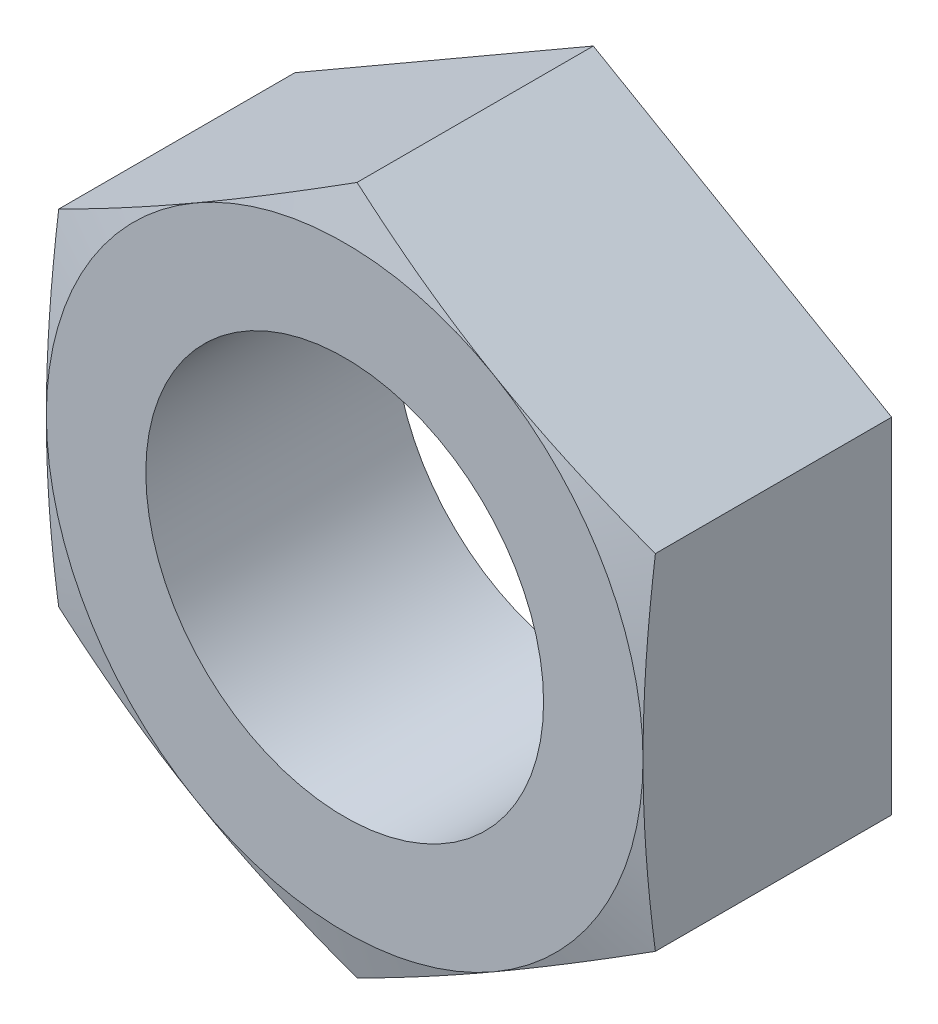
ISO-10303-21;
HEADER;
FILE_DESCRIPTION(('STEP AP214'),'2;1');
FILE_NAME('part.step','',(''),(''),'','','');
FILE_SCHEMA(('AUTOMOTIVE_DESIGN { 1 0 10303 214 1 1 1 1 }'));
ENDSEC;
DATA;
#1=APPLICATION_CONTEXT('core data for automotive mechanical design processes');
#2=APPLICATION_PROTOCOL_DEFINITION('international standard','automotive_design',2000,#1);
#3=PRODUCT_CONTEXT('',#1,'mechanical');
#4=PRODUCT('Part','Part','',(#3));
#5=PRODUCT_RELATED_PRODUCT_CATEGORY('part','',(#4));
#6=PRODUCT_DEFINITION_FORMATION('','',#4);
#7=PRODUCT_DEFINITION_CONTEXT('part definition',#1,'design');
#8=PRODUCT_DEFINITION('design','',#6,#7);
#9=PRODUCT_DEFINITION_SHAPE('','',#8);
#10=(LENGTH_UNIT() NAMED_UNIT(*) SI_UNIT(.MILLI.,.METRE.));
#11=(NAMED_UNIT(*) PLANE_ANGLE_UNIT() SI_UNIT($,.RADIAN.));
#12=(NAMED_UNIT(*) SI_UNIT($,.STERADIAN.) SOLID_ANGLE_UNIT());
#13=UNCERTAINTY_MEASURE_WITH_UNIT(LENGTH_MEASURE(1.E-05),#10,'distance_accuracy_value','');
#14=(GEOMETRIC_REPRESENTATION_CONTEXT(3) GLOBAL_UNCERTAINTY_ASSIGNED_CONTEXT((#13)) GLOBAL_UNIT_ASSIGNED_CONTEXT((#10,
#11,#12)) REPRESENTATION_CONTEXT('',''));
#15=CARTESIAN_POINT('',(0.,0.,0.));
#16=DIRECTION('',(0.,0.,1.));
#17=DIRECTION('',(1.,0.,0.));
#18=AXIS2_PLACEMENT_3D('',#15,#16,#17);
#19=CARTESIAN_POINT('',(0.,0.,10.));
#20=DIRECTION('',(0.,0.,1.));
#21=DIRECTION('',(1.,0.,0.));
#22=AXIS2_PLACEMENT_3D('',#19,#20,#21);
#23=PLANE('',#22);
#24=CARTESIAN_POINT('',(0.,0.,10.));
#25=DIRECTION('',(0.,0.,1.));
#26=DIRECTION('',(1.,0.,0.));
#27=AXIS2_PLACEMENT_3D('',#24,#25,#26);
#28=CIRCLE('',#27,8.);
#29=CARTESIAN_POINT('',(8.,0.,10.));
#30=VERTEX_POINT('',#29);
#31=EDGE_CURVE('E248',#30,#30,#28,.T.);
#32=ORIENTED_EDGE('',*,*,#31,.F.);
#33=EDGE_LOOP('',(#32));
#34=FACE_BOUND('',#33,.T.);
#35=CARTESIAN_POINT('',(0.,0.,10.));
#36=DIRECTION('',(0.,0.,1.));
#37=DIRECTION('',(1.,0.,0.));
#38=AXIS2_PLACEMENT_3D('',#35,#36,#37);
#39=CIRCLE('',#38,12.);
#40=CARTESIAN_POINT('',(6.,-10.3923048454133,10.));
#41=VERTEX_POINT('',#40);
#42=CARTESIAN_POINT('',(12.,0.,10.));
#43=VERTEX_POINT('',#42);
#44=EDGE_CURVE('E118',#41,#43,#39,.T.);
#45=ORIENTED_EDGE('',*,*,#44,.T.);
#46=CARTESIAN_POINT('',(6.,10.3923048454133,10.));
#47=VERTEX_POINT('',#46);
#48=EDGE_CURVE('E102',#43,#47,#39,.T.);
#49=ORIENTED_EDGE('',*,*,#48,.T.);
#50=CARTESIAN_POINT('',(-6.,10.3923048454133,10.));
#51=VERTEX_POINT('',#50);
#52=EDGE_CURVE('E92',#47,#51,#39,.T.);
#53=ORIENTED_EDGE('',*,*,#52,.T.);
#54=CARTESIAN_POINT('',(-12.,0.,10.));
#55=VERTEX_POINT('',#54);
#56=EDGE_CURVE('E36',#51,#55,#39,.T.);
#57=ORIENTED_EDGE('',*,*,#56,.T.);
#58=CARTESIAN_POINT('',(-6.,-10.3923048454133,10.));
#59=VERTEX_POINT('',#58);
#60=EDGE_CURVE('E44',#55,#59,#39,.T.);
#61=ORIENTED_EDGE('',*,*,#60,.T.);
#62=EDGE_CURVE('E122',#59,#41,#39,.T.);
#63=ORIENTED_EDGE('',*,*,#62,.T.);
#64=EDGE_LOOP('',(#45,#49,#53,#57,#61,#63));
#65=FACE_BOUND('',#64,.T.);
#66=ADVANCED_FACE('F14',(#34,#65),#23,.T.);
#67=CARTESIAN_POINT('',(12.,6.92820323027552,10.));
#68=DIRECTION('',(-0.5,-0.866025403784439,0.));
#69=DIRECTION('',(0.866025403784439,-0.5,0.));
#70=AXIS2_PLACEMENT_3D('',#67,#68,#69);
#71=PLANE('',#70);
#72=CARTESIAN_POINT('',(12.0002,6.92808776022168,9.50254644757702));
#73=CARTESIAN_POINT('',(11.5018535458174,7.2158082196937,9.57967201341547));
#74=CARTESIAN_POINT('',(11.0026035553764,7.50405033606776,9.6496892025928));
#75=CARTESIAN_POINT('',(10.0023405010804,8.08155247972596,9.7727027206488));
#76=CARTESIAN_POINT('',(9.50132680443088,8.37081287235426,9.82569213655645));
#77=CARTESIAN_POINT('',(8.50057386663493,8.94859785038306,9.91155672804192));
#78=CARTESIAN_POINT('',(8.00084139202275,9.2371185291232,9.94453429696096));
#79=CARTESIAN_POINT('',(7.00073918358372,9.81452780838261,9.98875383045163));
#80=CARTESIAN_POINT('',(6.50036959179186,10.1034163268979,10.));
#81=CARTESIAN_POINT('',(5.49963040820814,10.6811933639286,10.));
#82=CARTESIAN_POINT('',(4.99926081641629,10.9700818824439,9.98875383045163));
#83=CARTESIAN_POINT('',(3.99915860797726,11.5474911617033,9.94453429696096));
#84=CARTESIAN_POINT('',(3.49942613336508,11.8360118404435,9.91155672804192));
#85=CARTESIAN_POINT('',(2.49867319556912,12.4137968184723,9.82569213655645));
#86=CARTESIAN_POINT('',(1.99765949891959,12.7030572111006,9.7727027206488));
#87=CARTESIAN_POINT('',(0.997396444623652,13.2805593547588,9.6496892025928));
#88=CARTESIAN_POINT('',(0.498146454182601,13.5688014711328,9.57967201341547));
#89=CARTESIAN_POINT('',(-0.000199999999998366,13.8565219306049,9.50254644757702));
#90=B_SPLINE_CURVE_WITH_KNOTS('',3,(#72,#73,#74,#75,#76,#77,#78,#79,#80,#81,#82,#83,#84,#85,#86,
#87,#88,#89),.UNSPECIFIED.,.F.,.F.,(4,2,2,2,2,2,2,2,4),(0.,1.74185054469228,3.48440735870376,
5.21797126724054,6.95119970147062,8.68442813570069,10.4179920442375,12.160548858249,
13.9023994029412),.UNSPECIFIED.);
#91=CARTESIAN_POINT('',(12.,6.92820323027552,9.50257738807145));
#92=VERTEX_POINT('',#91);
#93=EDGE_CURVE('E107',#92,#47,#90,.T.);
#94=ORIENTED_EDGE('',*,*,#93,.F.);
#95=DIRECTION('',(0.,0.,-1.));
#96=VECTOR('',#95,1.);
#97=CARTESIAN_POINT('',(12.,6.92820323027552,10.));
#98=LINE('',#97,#96);
#99=CARTESIAN_POINT('',(12.,6.92820323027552,0.));
#100=VERTEX_POINT('',#99);
#101=EDGE_CURVE('E224',#92,#100,#98,.T.);
#102=ORIENTED_EDGE('',*,*,#101,.T.);
#103=DIRECTION('',(-0.866025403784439,0.5,0.));
#104=VECTOR('',#103,1.);
#105=CARTESIAN_POINT('',(12.,6.92820323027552,0.));
#106=LINE('',#105,#104);
#107=CARTESIAN_POINT('',(0.,13.856406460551,0.));
#108=VERTEX_POINT('',#107);
#109=EDGE_CURVE('E246',#100,#108,#106,.T.);
#110=ORIENTED_EDGE('',*,*,#109,.T.);
#111=DIRECTION('',(0.,0.,-1.));
#112=VECTOR('',#111,1.);
#113=CARTESIAN_POINT('',(0.,13.856406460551,10.));
#114=LINE('',#113,#112);
#115=CARTESIAN_POINT('',(0.,13.856406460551,9.50257738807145));
#116=VERTEX_POINT('',#115);
#117=EDGE_CURVE('E115',#116,#108,#114,.T.);
#118=ORIENTED_EDGE('',*,*,#117,.F.);
#119=EDGE_CURVE('E96',#47,#116,#90,.T.);
#120=ORIENTED_EDGE('',*,*,#119,.F.);
#121=EDGE_LOOP('',(#94,#102,#110,#118,#120));
#122=FACE_BOUND('',#121,.T.);
#123=ADVANCED_FACE('F16',(#122),#71,.F.);
#124=CARTESIAN_POINT('',(0.,13.856406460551,10.));
#125=DIRECTION('',(0.5,-0.866025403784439,0.));
#126=DIRECTION('',(0.866025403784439,0.5,0.));
#127=AXIS2_PLACEMENT_3D('',#124,#125,#126);
#128=PLANE('',#127);
#129=CARTESIAN_POINT('',(0.00020000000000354,13.8565219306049,9.50254644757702));
#130=CARTESIAN_POINT('',(-0.498146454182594,13.5688014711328,9.57967201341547));
#131=CARTESIAN_POINT('',(-0.997396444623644,13.2805593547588,9.6496892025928));
#132=CARTESIAN_POINT('',(-1.99765949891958,12.7030572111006,9.7727027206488));
#133=CARTESIAN_POINT('',(-2.49867319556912,12.4137968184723,9.82569213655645));
#134=CARTESIAN_POINT('',(-3.49942613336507,11.8360118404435,9.91155672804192));
#135=CARTESIAN_POINT('',(-3.99915860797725,11.5474911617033,9.94453429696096));
#136=CARTESIAN_POINT('',(-4.99926081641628,10.9700818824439,9.98875383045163));
#137=CARTESIAN_POINT('',(-5.49963040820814,10.6811933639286,10.));
#138=CARTESIAN_POINT('',(-6.50036959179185,10.1034163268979,10.));
#139=CARTESIAN_POINT('',(-7.00073918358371,9.8145278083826,9.98875383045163));
#140=CARTESIAN_POINT('',(-8.00084139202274,9.23711852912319,9.94453429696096));
#141=CARTESIAN_POINT('',(-8.50057386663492,8.94859785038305,9.91155672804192));
#142=CARTESIAN_POINT('',(-9.50132680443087,8.37081287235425,9.82569213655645));
#143=CARTESIAN_POINT('',(-10.0023405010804,8.08155247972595,9.7727027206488));
#144=CARTESIAN_POINT('',(-11.0026035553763,7.50405033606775,9.6496892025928));
#145=CARTESIAN_POINT('',(-11.5018535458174,7.2158082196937,9.57967201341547));
#146=CARTESIAN_POINT('',(-12.0002,6.92808776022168,9.50254644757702));
#147=B_SPLINE_CURVE_WITH_KNOTS('',3,(#129,#130,#131,#132,#133,#134,#135,#136,#137,#138,#139,
#140,#141,#142,#143,#144,#145,#146),.UNSPECIFIED.,.F.,.F.,(4,2,2,2,2,2,2,2,4),(0.,
1.74185054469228,3.48440735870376,5.21797126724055,6.95119970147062,8.68442813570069,
10.4179920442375,12.160548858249,13.9023994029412),.UNSPECIFIED.);
#148=EDGE_CURVE('E98',#116,#51,#147,.T.);
#149=ORIENTED_EDGE('',*,*,#148,.F.);
#150=ORIENTED_EDGE('',*,*,#117,.T.);
#151=DIRECTION('',(-0.866025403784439,-0.5,0.));
#152=VECTOR('',#151,1.);
#153=CARTESIAN_POINT('',(0.,13.856406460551,0.));
#154=LINE('',#153,#152);
#155=CARTESIAN_POINT('',(-12.,6.92820323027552,0.));
#156=VERTEX_POINT('',#155);
#157=EDGE_CURVE('E244',#108,#156,#154,.T.);
#158=ORIENTED_EDGE('',*,*,#157,.T.);
#159=DIRECTION('',(0.,0.,-1.));
#160=VECTOR('',#159,1.);
#161=CARTESIAN_POINT('',(-12.,6.92820323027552,10.));
#162=LINE('',#161,#160);
#163=CARTESIAN_POINT('',(-12.,6.92820323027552,9.50257738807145));
#164=VERTEX_POINT('',#163);
#165=EDGE_CURVE('E225',#164,#156,#162,.T.);
#166=ORIENTED_EDGE('',*,*,#165,.F.);
#167=EDGE_CURVE('E171',#51,#164,#147,.T.);
#168=ORIENTED_EDGE('',*,*,#167,.F.);
#169=EDGE_LOOP('',(#149,#150,#158,#166,#168));
#170=FACE_BOUND('',#169,.T.);
#171=ADVANCED_FACE('F182',(#170),#128,.F.);
#172=CARTESIAN_POINT('',(-12.,6.92820323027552,10.));
#173=DIRECTION('',(1.,0.,0.));
#174=DIRECTION('',(0.,1.,0.));
#175=AXIS2_PLACEMENT_3D('',#172,#173,#174);
#176=PLANE('',#175);
#177=CARTESIAN_POINT('',(-12.,-18.3760772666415,7.33465196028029));
#178=CARTESIAN_POINT('',(-12.,-17.8311157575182,7.45688131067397));
#179=CARTESIAN_POINT('',(-12.,-17.2858147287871,7.57762386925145));
#180=CARTESIAN_POINT('',(-12.,-16.1943667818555,7.81533278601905));
#181=CARTESIAN_POINT('',(-12.,-15.6482198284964,7.932298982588));
#182=CARTESIAN_POINT('',(-12.,-14.5544308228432,8.16175292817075));
#183=CARTESIAN_POINT('',(-12.,-14.006787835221,8.2742362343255));
#184=CARTESIAN_POINT('',(-12.,-12.9103655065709,8.49351801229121));
#185=CARTESIAN_POINT('',(-12.,-12.361586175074,8.60031653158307));
#186=CARTESIAN_POINT('',(-12.,-11.2670719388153,8.80605034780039));
#187=CARTESIAN_POINT('',(-12.,-10.721347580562,8.90504147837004));
#188=CARTESIAN_POINT('',(-12.,-9.62839905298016,9.09443694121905));
#189=CARTESIAN_POINT('',(-12.,-9.08117487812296,9.18484124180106));
#190=CARTESIAN_POINT('',(-12.,-7.98513551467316,9.3550337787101));
#191=CARTESIAN_POINT('',(-12.,-7.43632053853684,9.43482337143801));
#192=CARTESIAN_POINT('',(-12.,-6.33694259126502,9.58144539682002));
#193=CARTESIAN_POINT('',(-12.,-5.78637961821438,9.6482778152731));
#194=CARTESIAN_POINT('',(-12.,-4.67727363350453,9.76710367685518));
#195=CARTESIAN_POINT('',(-12.,-4.11871125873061,9.81891906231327));
#196=CARTESIAN_POINT('',(-12.,-3.0001718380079,9.90414274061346));
#197=CARTESIAN_POINT('',(-12.,-2.44019482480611,9.93755145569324));
#198=CARTESIAN_POINT('',(-12.,-1.31963996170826,9.98401383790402));
#199=CARTESIAN_POINT('',(-12.,-0.759062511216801,9.99707694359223));
#200=CARTESIAN_POINT('',(-12.,0.362187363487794,10.002043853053));
#201=CARTESIAN_POINT('',(-12.,0.922859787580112,9.99394768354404));
#202=CARTESIAN_POINT('',(-12.,2.04555807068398,9.9570507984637));
#203=CARTESIAN_POINT('',(-12.,2.60758139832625,9.9281746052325));
#204=CARTESIAN_POINT('',(-12.,3.73031273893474,9.85137028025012));
#205=CARTESIAN_POINT('',(-12.,4.29102072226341,9.80344172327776));
#206=CARTESIAN_POINT('',(-12.,5.41111567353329,9.69096567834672));
#207=CARTESIAN_POINT('',(-12.,5.97050152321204,9.62640722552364));
#208=CARTESIAN_POINT('',(-12.,7.08747104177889,9.48337256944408));
#209=CARTESIAN_POINT('',(-12.,7.64505470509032,9.40489632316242));
#210=CARTESIAN_POINT('',(-12.,8.72595613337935,9.24146783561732));
#211=CARTESIAN_POINT('',(-12.,9.24937259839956,9.15716182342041));
#212=CARTESIAN_POINT('',(-12.,10.2948126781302,8.98027669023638));
#213=CARTESIAN_POINT('',(-12.,10.8168362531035,8.88769733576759));
#214=CARTESIAN_POINT('',(-12.,11.8596911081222,8.69578846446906));
#215=CARTESIAN_POINT('',(-12.,12.3805222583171,8.59645824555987));
#216=CARTESIAN_POINT('',(-12.,13.4210973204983,8.39230238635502));
#217=CARTESIAN_POINT('',(-12.,13.9408412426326,8.28747679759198));
#218=CARTESIAN_POINT('',(-12.,14.9795291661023,8.07330464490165));
#219=CARTESIAN_POINT('',(-12.,15.4984729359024,7.96395696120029));
#220=CARTESIAN_POINT('',(-12.,16.5355673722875,7.74155770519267));
#221=CARTESIAN_POINT('',(-12.,17.0537180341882,7.62850611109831));
#222=CARTESIAN_POINT('',(-12.,18.6070874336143,7.28480299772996));
#223=CARTESIAN_POINT('',(-12.,19.6412960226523,7.04958801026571));
#224=CARTESIAN_POINT('',(-12.,21.6975152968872,6.57306070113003));
#225=CARTESIAN_POINT('',(-12.,22.7195454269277,6.33183173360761));
#226=CARTESIAN_POINT('',(-12.,24.7621852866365,5.84335995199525));
#227=CARTESIAN_POINT('',(-12.,25.7827949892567,5.59611702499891));
#228=CARTESIAN_POINT('',(-12.,27.8216374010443,5.09750048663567));
#229=CARTESIAN_POINT('',(-12.,28.8398714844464,4.84613248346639));
#230=CARTESIAN_POINT('',(-12.,30.366576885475,4.46655908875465));
#231=CARTESIAN_POINT('',(-12.,30.875362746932,4.33961648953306));
#232=CARTESIAN_POINT('',(-12.,31.892747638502,4.08498700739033));
#233=CARTESIAN_POINT('',(-12.,32.4013466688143,3.95730012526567));
#234=CARTESIAN_POINT('',(-12.,32.9098642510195,3.82928971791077));
#235=B_SPLINE_CURVE_WITH_KNOTS('',3,(#177,#178,#179,#180,#181,#182,#183,#184,#185,#186,#187,
#188,#189,#190,#191,#192,#193,#194,#195,#196,#197,#198,#199,#200,#201,#202,#203,#204,#205,#206,
#207,#208,#209,#210,#211,#212,#213,#214,#215,#216,#217,#218,#219,#220,#221,#222,#223,#224,#225,
#226,#227,#228,#229,#230,#231,#232,#233,#234),.UNSPECIFIED.,.F.,.F.,(4,2,2,2,2,2,2,2,2,2,2,2,2,
2,2,2,2,2,2,2,2,2,2,2,2,2,2,2,4),(0.,1.675508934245,3.35108948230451,5.02829132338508,
6.70547915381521,8.36931403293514,10.0331550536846,11.6967832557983,13.3604132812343,
15.043029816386,16.7256077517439,18.4074048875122,20.0891998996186,21.7771345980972,
23.4651069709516,25.1541951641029,26.843288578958,28.433697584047,30.0241514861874,
31.6147710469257,33.2053756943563,34.7963765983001,36.3873868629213,39.5691854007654,
42.7195027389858,45.8698792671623,49.0162790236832,50.5894274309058,52.1625741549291),.UNSPECIFIED.);
#236=EDGE_CURVE('E176',#164,#55,#235,.F.);
#237=ORIENTED_EDGE('',*,*,#236,.F.);
#238=ORIENTED_EDGE('',*,*,#165,.T.);
#239=DIRECTION('',(0.,-1.,0.));
#240=VECTOR('',#239,1.);
#241=CARTESIAN_POINT('',(-12.,6.92820323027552,0.));
#242=LINE('',#241,#240);
#243=CARTESIAN_POINT('',(-12.,-6.92820323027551,0.));
#244=VERTEX_POINT('',#243);
#245=EDGE_CURVE('E241',#156,#244,#242,.T.);
#246=ORIENTED_EDGE('',*,*,#245,.T.);
#247=DIRECTION('',(0.,0.,-1.));
#248=VECTOR('',#247,1.);
#249=CARTESIAN_POINT('',(-12.,-6.92820323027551,10.));
#250=LINE('',#249,#248);
#251=CARTESIAN_POINT('',(-12.,-6.92820323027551,9.50257738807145));
#252=VERTEX_POINT('',#251);
#253=EDGE_CURVE('E228',#252,#244,#250,.T.);
#254=ORIENTED_EDGE('',*,*,#253,.F.);
#255=EDGE_CURVE('E134',#55,#252,#235,.F.);
#256=ORIENTED_EDGE('',*,*,#255,.F.);
#257=EDGE_LOOP('',(#237,#238,#246,#254,#256));
#258=FACE_BOUND('',#257,.T.);
#259=ADVANCED_FACE('F185',(#258),#176,.F.);
#260=CARTESIAN_POINT('',(-12.,-6.92820323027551,10.));
#261=DIRECTION('',(0.5,0.866025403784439,0.));
#262=DIRECTION('',(-0.866025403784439,0.5,0.));
#263=AXIS2_PLACEMENT_3D('',#260,#261,#262);
#264=PLANE('',#263);
#265=CARTESIAN_POINT('',(-12.0002,-6.92808776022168,9.50254644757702));
#266=CARTESIAN_POINT('',(-11.5018535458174,-7.21580821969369,9.57967201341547));
#267=CARTESIAN_POINT('',(-11.0026035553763,-7.50405033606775,9.6496892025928));
#268=CARTESIAN_POINT('',(-10.0023405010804,-8.08155247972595,9.7727027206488));
#269=CARTESIAN_POINT('',(-9.50132680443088,-8.37081287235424,9.82569213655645));
#270=CARTESIAN_POINT('',(-8.50057386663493,-8.94859785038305,9.91155672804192));
#271=CARTESIAN_POINT('',(-8.00084139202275,-9.23711852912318,9.94453429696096));
#272=CARTESIAN_POINT('',(-7.00073918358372,-9.8145278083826,9.98875383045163));
#273=CARTESIAN_POINT('',(-6.50036959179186,-10.1034163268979,10.));
#274=CARTESIAN_POINT('',(-5.49963040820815,-10.6811933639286,10.));
#275=CARTESIAN_POINT('',(-4.99926081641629,-10.9700818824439,9.98875383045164));
#276=CARTESIAN_POINT('',(-3.99915860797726,-11.5474911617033,9.94453429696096));
#277=CARTESIAN_POINT('',(-3.49942613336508,-11.8360118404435,9.91155672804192));
#278=CARTESIAN_POINT('',(-2.49867319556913,-12.4137968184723,9.82569213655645));
#279=CARTESIAN_POINT('',(-1.99765949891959,-12.7030572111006,9.77270272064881));
#280=CARTESIAN_POINT('',(-0.997396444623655,-13.2805593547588,9.6496892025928));
#281=CARTESIAN_POINT('',(-0.498146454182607,-13.5688014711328,9.57967201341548));
#282=CARTESIAN_POINT('',(0.000199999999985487,-13.8565219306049,9.50254644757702));
#283=B_SPLINE_CURVE_WITH_KNOTS('',3,(#265,#266,#267,#268,#269,#270,#271,#272,#273,#274,#275,
#276,#277,#278,#279,#280,#281,#282),.UNSPECIFIED.,.F.,.F.,(4,2,2,2,2,2,2,2,4),(0.,
1.74185054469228,3.48440735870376,5.21797126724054,6.95119970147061,8.68442813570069,
10.4179920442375,12.1605488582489,13.9023994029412),.UNSPECIFIED.);
#284=EDGE_CURVE('E131',#252,#59,#283,.T.);
#285=ORIENTED_EDGE('',*,*,#284,.F.);
#286=ORIENTED_EDGE('',*,*,#253,.T.);
#287=DIRECTION('',(0.866025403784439,-0.5,0.));
#288=VECTOR('',#287,1.);
#289=CARTESIAN_POINT('',(-12.,-6.92820323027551,0.));
#290=LINE('',#289,#288);
#291=CARTESIAN_POINT('',(0.,-13.856406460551,0.));
#292=VERTEX_POINT('',#291);
#293=EDGE_CURVE('E239',#244,#292,#290,.T.);
#294=ORIENTED_EDGE('',*,*,#293,.T.);
#295=DIRECTION('',(0.,0.,-1.));
#296=VECTOR('',#295,1.);
#297=CARTESIAN_POINT('',(0.,-13.856406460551,10.));
#298=LINE('',#297,#296);
#299=CARTESIAN_POINT('',(0.,-13.856406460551,9.50257738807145));
#300=VERTEX_POINT('',#299);
#301=EDGE_CURVE('E141',#300,#292,#298,.T.);
#302=ORIENTED_EDGE('',*,*,#301,.F.);
#303=EDGE_CURVE('E127',#59,#300,#283,.T.);
#304=ORIENTED_EDGE('',*,*,#303,.F.);
#305=EDGE_LOOP('',(#285,#286,#294,#302,#304));
#306=FACE_BOUND('',#305,.T.);
#307=ADVANCED_FACE('F139',(#306),#264,.F.);
#308=CARTESIAN_POINT('',(0.,-13.856406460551,10.));
#309=DIRECTION('',(-0.5,0.866025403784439,0.));
#310=DIRECTION('',(-0.866025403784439,-0.5,0.));
#311=AXIS2_PLACEMENT_3D('',#308,#309,#310);
#312=PLANE('',#311);
#313=CARTESIAN_POINT('',(-0.000200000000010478,-13.8565219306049,9.50254644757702));
#314=CARTESIAN_POINT('',(0.498146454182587,-13.5688014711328,9.57967201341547));
#315=CARTESIAN_POINT('',(0.997396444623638,-13.2805593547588,9.6496892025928));
#316=CARTESIAN_POINT('',(1.99765949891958,-12.7030572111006,9.7727027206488));
#317=CARTESIAN_POINT('',(2.49867319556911,-12.4137968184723,9.82569213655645));
#318=CARTESIAN_POINT('',(3.49942613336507,-11.8360118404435,9.91155672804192));
#319=CARTESIAN_POINT('',(3.99915860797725,-11.5474911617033,9.94453429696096));
#320=CARTESIAN_POINT('',(4.99926081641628,-10.9700818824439,9.98875383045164));
#321=CARTESIAN_POINT('',(5.49963040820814,-10.6811933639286,10.));
#322=CARTESIAN_POINT('',(6.50036959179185,-10.1034163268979,10.));
#323=CARTESIAN_POINT('',(7.00073918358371,-9.8145278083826,9.98875383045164));
#324=CARTESIAN_POINT('',(8.00084139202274,-9.23711852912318,9.94453429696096));
#325=CARTESIAN_POINT('',(8.50057386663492,-8.94859785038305,9.91155672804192));
#326=CARTESIAN_POINT('',(9.50132680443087,-8.37081287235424,9.82569213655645));
#327=CARTESIAN_POINT('',(10.0023405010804,-8.08155247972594,9.77270272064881));
#328=CARTESIAN_POINT('',(11.0026035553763,-7.50405033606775,9.6496892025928));
#329=CARTESIAN_POINT('',(11.5018535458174,-7.21580821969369,9.57967201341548));
#330=CARTESIAN_POINT('',(12.0002,-6.92808776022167,9.50254644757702));
#331=B_SPLINE_CURVE_WITH_KNOTS('',3,(#313,#314,#315,#316,#317,#318,#319,#320,#321,#322,#323,
#324,#325,#326,#327,#328,#329,#330),.UNSPECIFIED.,.F.,.F.,(4,2,2,2,2,2,2,2,4),(0.,
1.74185054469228,3.48440735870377,5.21797126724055,6.95119970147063,8.6844281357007,
10.4179920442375,12.160548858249,13.9023994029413),.UNSPECIFIED.);
#332=EDGE_CURVE('E120',#300,#41,#331,.T.);
#333=ORIENTED_EDGE('',*,*,#332,.F.);
#334=ORIENTED_EDGE('',*,*,#301,.T.);
#335=DIRECTION('',(0.866025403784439,0.5,0.));
#336=VECTOR('',#335,1.);
#337=CARTESIAN_POINT('',(0.,-13.856406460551,0.));
#338=LINE('',#337,#336);
#339=CARTESIAN_POINT('',(12.,-6.92820323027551,0.));
#340=VERTEX_POINT('',#339);
#341=EDGE_CURVE('E237',#292,#340,#338,.T.);
#342=ORIENTED_EDGE('',*,*,#341,.T.);
#343=DIRECTION('',(0.,0.,-1.));
#344=VECTOR('',#343,1.);
#345=CARTESIAN_POINT('',(12.,-6.92820323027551,10.));
#346=LINE('',#345,#344);
#347=CARTESIAN_POINT('',(12.,-6.92820323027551,9.50257738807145));
#348=VERTEX_POINT('',#347);
#349=EDGE_CURVE('E220',#348,#340,#346,.T.);
#350=ORIENTED_EDGE('',*,*,#349,.F.);
#351=EDGE_CURVE('E119',#41,#348,#331,.T.);
#352=ORIENTED_EDGE('',*,*,#351,.F.);
#353=EDGE_LOOP('',(#333,#334,#342,#350,#352));
#354=FACE_BOUND('',#353,.T.);
#355=ADVANCED_FACE('F195',(#354),#312,.F.);
#356=CARTESIAN_POINT('',(12.,-6.92820323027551,10.));
#357=DIRECTION('',(-1.,0.,0.));
#358=DIRECTION('',(0.,-1.,0.));
#359=AXIS2_PLACEMENT_3D('',#356,#357,#358);
#360=PLANE('',#359);
#361=CARTESIAN_POINT('',(12.,-18.3760772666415,7.33465196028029));
#362=CARTESIAN_POINT('',(12.,-17.8311157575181,7.45688131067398));
#363=CARTESIAN_POINT('',(12.,-17.2858147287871,7.57762386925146));
#364=CARTESIAN_POINT('',(12.,-16.1943667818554,7.81533278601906));
#365=CARTESIAN_POINT('',(12.,-15.6482198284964,7.93229898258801));
#366=CARTESIAN_POINT('',(12.,-14.5544308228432,8.16175292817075));
#367=CARTESIAN_POINT('',(12.,-14.0067878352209,8.27423623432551));
#368=CARTESIAN_POINT('',(12.,-12.9103655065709,8.49351801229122));
#369=CARTESIAN_POINT('',(12.,-12.3615861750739,8.60031653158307));
#370=CARTESIAN_POINT('',(12.,-11.2670719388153,8.8060503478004));
#371=CARTESIAN_POINT('',(12.,-10.7213475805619,8.90504147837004));
#372=CARTESIAN_POINT('',(12.,-9.62839905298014,9.09443694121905));
#373=CARTESIAN_POINT('',(12.,-9.08117487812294,9.18484124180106));
#374=CARTESIAN_POINT('',(12.,-7.98513551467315,9.3550337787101));
#375=CARTESIAN_POINT('',(12.,-7.43632053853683,9.43482337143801));
#376=CARTESIAN_POINT('',(12.,-6.33694259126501,9.58144539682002));
#377=CARTESIAN_POINT('',(12.,-5.78637961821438,9.6482778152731));
#378=CARTESIAN_POINT('',(12.,-4.67727363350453,9.76710367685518));
#379=CARTESIAN_POINT('',(12.,-4.1187112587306,9.81891906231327));
#380=CARTESIAN_POINT('',(12.,-3.0001718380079,9.90414274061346));
#381=CARTESIAN_POINT('',(12.,-2.44019482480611,9.93755145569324));
#382=CARTESIAN_POINT('',(12.,-1.31963996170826,9.98401383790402));
#383=CARTESIAN_POINT('',(12.,-0.759062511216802,9.99707694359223));
#384=CARTESIAN_POINT('',(12.,0.362187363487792,10.002043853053));
#385=CARTESIAN_POINT('',(12.,0.922859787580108,9.99394768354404));
#386=CARTESIAN_POINT('',(12.,2.04555807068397,9.95705079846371));
#387=CARTESIAN_POINT('',(12.,2.60758139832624,9.9281746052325));
#388=CARTESIAN_POINT('',(12.,3.73031273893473,9.85137028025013));
#389=CARTESIAN_POINT('',(12.,4.2910207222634,9.80344172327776));
#390=CARTESIAN_POINT('',(12.,5.41111567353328,9.69096567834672));
#391=CARTESIAN_POINT('',(12.,5.97050152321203,9.62640722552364));
#392=CARTESIAN_POINT('',(12.,7.08747104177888,9.48337256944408));
#393=CARTESIAN_POINT('',(12.,7.64505470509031,9.40489632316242));
#394=CARTESIAN_POINT('',(12.,8.72595613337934,9.24146783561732));
#395=CARTESIAN_POINT('',(12.,9.24937259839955,9.15716182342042));
#396=CARTESIAN_POINT('',(12.,10.2948126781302,8.98027669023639));
#397=CARTESIAN_POINT('',(12.,10.8168362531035,8.8876973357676));
#398=CARTESIAN_POINT('',(12.,11.8596911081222,8.69578846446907));
#399=CARTESIAN_POINT('',(12.,12.3805222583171,8.59645824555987));
#400=CARTESIAN_POINT('',(12.,13.4210973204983,8.39230238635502));
#401=CARTESIAN_POINT('',(12.,13.9408412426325,8.28747679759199));
#402=CARTESIAN_POINT('',(12.,14.9795291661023,8.07330464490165));
#403=CARTESIAN_POINT('',(12.,15.4984729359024,7.96395696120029));
#404=CARTESIAN_POINT('',(12.,16.5355673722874,7.74155770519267));
#405=CARTESIAN_POINT('',(12.,17.0537180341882,7.62850611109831));
#406=CARTESIAN_POINT('',(12.,18.6070874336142,7.28480299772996));
#407=CARTESIAN_POINT('',(12.,19.6412960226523,7.04958801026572));
#408=CARTESIAN_POINT('',(12.,21.6975152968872,6.57306070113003));
#409=CARTESIAN_POINT('',(12.,22.7195454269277,6.33183173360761));
#410=CARTESIAN_POINT('',(12.,24.7621852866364,5.84335995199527));
#411=CARTESIAN_POINT('',(12.,25.7827949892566,5.59611702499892));
#412=CARTESIAN_POINT('',(12.,27.8216374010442,5.09750048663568));
#413=CARTESIAN_POINT('',(12.,28.8398714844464,4.84613248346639));
#414=CARTESIAN_POINT('',(12.,30.366576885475,4.46655908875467));
#415=CARTESIAN_POINT('',(12.,30.8753627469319,4.33961648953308));
#416=CARTESIAN_POINT('',(12.,31.8927476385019,4.08498700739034));
#417=CARTESIAN_POINT('',(12.,32.4013466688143,3.95730012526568));
#418=CARTESIAN_POINT('',(12.,32.9098642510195,3.82928971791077));
#419=B_SPLINE_CURVE_WITH_KNOTS('',3,(#361,#362,#363,#364,#365,#366,#367,#368,#369,#370,#371,
#372,#373,#374,#375,#376,#377,#378,#379,#380,#381,#382,#383,#384,#385,#386,#387,#388,#389,#390,
#391,#392,#393,#394,#395,#396,#397,#398,#399,#400,#401,#402,#403,#404,#405,#406,#407,#408,#409,
#410,#411,#412,#413,#414,#415,#416,#417,#418),.UNSPECIFIED.,.F.,.F.,(4,2,2,2,2,2,2,2,2,2,2,2,2,
2,2,2,2,2,2,2,2,2,2,2,2,2,2,2,4),(0.,1.675508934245,3.35108948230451,5.02829132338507,
6.70547915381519,8.36931403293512,10.0331550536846,11.6967832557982,13.3604132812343,
15.043029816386,16.7256077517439,18.4074048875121,20.0891998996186,21.7771345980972,
23.4651069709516,25.1541951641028,26.8432885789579,28.433697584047,30.0241514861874,
31.6147710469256,33.2053756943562,34.7963765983,36.3873868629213,39.5691854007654,
42.7195027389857,45.8698792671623,49.0162790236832,50.5894274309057,52.162574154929),.UNSPECIFIED.);
#420=EDGE_CURVE('E9',#348,#43,#419,.T.);
#421=ORIENTED_EDGE('',*,*,#420,.F.);
#422=ORIENTED_EDGE('',*,*,#349,.T.);
#423=DIRECTION('',(0.,1.,0.));
#424=VECTOR('',#423,1.);
#425=CARTESIAN_POINT('',(12.,-6.92820323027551,0.));
#426=LINE('',#425,#424);
#427=EDGE_CURVE('E235',#340,#100,#426,.T.);
#428=ORIENTED_EDGE('',*,*,#427,.T.);
#429=ORIENTED_EDGE('',*,*,#101,.F.);
#430=EDGE_CURVE('E19',#43,#92,#419,.T.);
#431=ORIENTED_EDGE('',*,*,#430,.F.);
#432=EDGE_LOOP('',(#421,#422,#428,#429,#431));
#433=FACE_BOUND('',#432,.T.);
#434=ADVANCED_FACE('F207',(#433),#360,.F.);
#435=CARTESIAN_POINT('',(0.,0.,0.));
#436=DIRECTION('',(0.,0.,1.));
#437=DIRECTION('',(1.,0.,0.));
#438=AXIS2_PLACEMENT_3D('',#435,#436,#437);
#439=PLANE('',#438);
#440=ORIENTED_EDGE('',*,*,#109,.F.);
#441=ORIENTED_EDGE('',*,*,#427,.F.);
#442=ORIENTED_EDGE('',*,*,#341,.F.);
#443=ORIENTED_EDGE('',*,*,#293,.F.);
#444=ORIENTED_EDGE('',*,*,#245,.F.);
#445=ORIENTED_EDGE('',*,*,#157,.F.);
#446=EDGE_LOOP('',(#440,#441,#442,#443,#444,#445));
#447=FACE_BOUND('',#446,.T.);
#448=CARTESIAN_POINT('',(0.,0.,0.));
#449=DIRECTION('',(0.,0.,1.));
#450=DIRECTION('',(1.,0.,0.));
#451=AXIS2_PLACEMENT_3D('',#448,#449,#450);
#452=CIRCLE('',#451,8.);
#453=CARTESIAN_POINT('',(8.,0.,0.));
#454=VERTEX_POINT('',#453);
#455=EDGE_CURVE('E111',#454,#454,#452,.T.);
#456=ORIENTED_EDGE('',*,*,#455,.T.);
#457=EDGE_LOOP('',(#456));
#458=FACE_BOUND('',#457,.T.);
#459=ADVANCED_FACE('F205',(#447,#458),#439,.F.);
#460=CARTESIAN_POINT('',(0.,0.,10.));
#461=DIRECTION('',(0.,0.,-1.));
#462=DIRECTION('',(-1.,0.,0.));
#463=AXIS2_PLACEMENT_3D('',#460,#461,#462);
#464=CYLINDRICAL_SURFACE('',#463,8.);
#465=ORIENTED_EDGE('',*,*,#31,.T.);
#466=EDGE_LOOP('',(#465));
#467=FACE_BOUND('',#466,.T.);
#468=ORIENTED_EDGE('',*,*,#455,.F.);
#469=EDGE_LOOP('',(#468));
#470=FACE_BOUND('',#469,.T.);
#471=ADVANCED_FACE('F164',(#467,#470),#464,.F.);
#472=CARTESIAN_POINT('',(0.,0.,10.));
#473=DIRECTION('',(0.,0.,-1.));
#474=DIRECTION('',(-1.,0.,0.));
#475=AXIS2_PLACEMENT_3D('',#472,#473,#474);
#476=CONICAL_SURFACE('',#475,12.,1.30899693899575);
#477=ORIENTED_EDGE('',*,*,#93,.T.);
#478=ORIENTED_EDGE('',*,*,#48,.F.);
#479=ORIENTED_EDGE('',*,*,#430,.T.);
#480=EDGE_LOOP('',(#477,#478,#479));
#481=FACE_BOUND('',#480,.T.);
#482=ADVANCED_FACE('F108',(#481),#476,.T.);
#483=ORIENTED_EDGE('',*,*,#351,.T.);
#484=ORIENTED_EDGE('',*,*,#420,.T.);
#485=ORIENTED_EDGE('',*,*,#44,.F.);
#486=EDGE_LOOP('',(#483,#484,#485));
#487=FACE_BOUND('',#486,.T.);
#488=ADVANCED_FACE('F163',(#487),#476,.T.);
#489=ORIENTED_EDGE('',*,*,#303,.T.);
#490=ORIENTED_EDGE('',*,*,#332,.T.);
#491=ORIENTED_EDGE('',*,*,#62,.F.);
#492=EDGE_LOOP('',(#489,#490,#491));
#493=FACE_BOUND('',#492,.T.);
#494=ADVANCED_FACE('F125',(#493),#476,.T.);
#495=ORIENTED_EDGE('',*,*,#255,.T.);
#496=ORIENTED_EDGE('',*,*,#284,.T.);
#497=ORIENTED_EDGE('',*,*,#60,.F.);
#498=EDGE_LOOP('',(#495,#496,#497));
#499=FACE_BOUND('',#498,.T.);
#500=ADVANCED_FACE('F132',(#499),#476,.T.);
#501=ORIENTED_EDGE('',*,*,#167,.T.);
#502=ORIENTED_EDGE('',*,*,#236,.T.);
#503=ORIENTED_EDGE('',*,*,#56,.F.);
#504=EDGE_LOOP('',(#501,#502,#503));
#505=FACE_BOUND('',#504,.T.);
#506=ADVANCED_FACE('F290',(#505),#476,.T.);
#507=ORIENTED_EDGE('',*,*,#119,.T.);
#508=ORIENTED_EDGE('',*,*,#148,.T.);
#509=ORIENTED_EDGE('',*,*,#52,.F.);
#510=EDGE_LOOP('',(#507,#508,#509));
#511=FACE_BOUND('',#510,.T.);
#512=ADVANCED_FACE('F94',(#511),#476,.T.);
#513=CLOSED_SHELL('',(#66,#123,#171,#259,#307,#355,#434,#459,#471,#482,#488,#494,#500,#506,#512));
#514=MANIFOLD_SOLID_BREP('B1',#513);
#515=ADVANCED_BREP_SHAPE_REPRESENTATION('',(#18,#514),#14);
#516=SHAPE_DEFINITION_REPRESENTATION(#9,#515);
ENDSEC;
END-ISO-10303-21;
